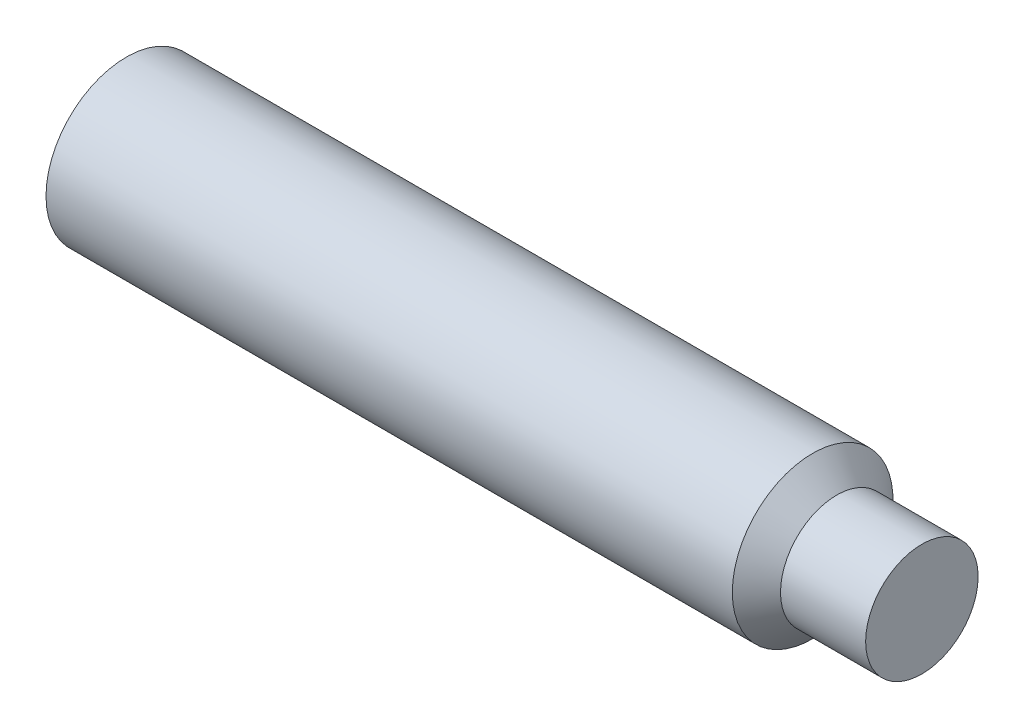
ISO-10303-21;
HEADER;
FILE_DESCRIPTION(('STEP AP214'),'2;1');
FILE_NAME('part.step','',(''),(''),'','','');
FILE_SCHEMA(('AUTOMOTIVE_DESIGN { 1 0 10303 214 1 1 1 1 }'));
ENDSEC;
DATA;
#1=APPLICATION_CONTEXT('core data for automotive mechanical design processes');
#2=APPLICATION_PROTOCOL_DEFINITION('international standard','automotive_design',2000,#1);
#3=PRODUCT_CONTEXT('',#1,'mechanical');
#4=PRODUCT('Part','Part','',(#3));
#5=PRODUCT_RELATED_PRODUCT_CATEGORY('part','',(#4));
#6=PRODUCT_DEFINITION_FORMATION('','',#4);
#7=PRODUCT_DEFINITION_CONTEXT('part definition',#1,'design');
#8=PRODUCT_DEFINITION('design','',#6,#7);
#9=PRODUCT_DEFINITION_SHAPE('','',#8);
#10=(LENGTH_UNIT() NAMED_UNIT(*) SI_UNIT(.MILLI.,.METRE.));
#11=(NAMED_UNIT(*) PLANE_ANGLE_UNIT() SI_UNIT($,.RADIAN.));
#12=(NAMED_UNIT(*) SI_UNIT($,.STERADIAN.) SOLID_ANGLE_UNIT());
#13=UNCERTAINTY_MEASURE_WITH_UNIT(LENGTH_MEASURE(1.E-05),#10,'distance_accuracy_value','');
#14=(GEOMETRIC_REPRESENTATION_CONTEXT(3) GLOBAL_UNCERTAINTY_ASSIGNED_CONTEXT((#13)) GLOBAL_UNIT_ASSIGNED_CONTEXT((#10,
#11,#12)) REPRESENTATION_CONTEXT('',''));
#15=CARTESIAN_POINT('',(0.,0.,0.));
#16=DIRECTION('',(0.,0.,1.));
#17=DIRECTION('',(1.,0.,0.));
#18=AXIS2_PLACEMENT_3D('',#15,#16,#17);
#19=CARTESIAN_POINT('',(0.,0.,0.));
#20=DIRECTION('',(-1.,0.,0.));
#21=DIRECTION('',(0.,0.,1.));
#22=AXIS2_PLACEMENT_3D('',#19,#20,#21);
#23=PLANE('',#22);
#24=CARTESIAN_POINT('',(0.,0.,0.));
#25=DIRECTION('',(-1.,0.,0.));
#26=DIRECTION('',(0.,0.,1.));
#27=AXIS2_PLACEMENT_3D('',#24,#25,#26);
#28=CIRCLE('',#27,4.172);
#29=CARTESIAN_POINT('',(0.,0.,4.172));
#30=VERTEX_POINT('',#29);
#31=EDGE_CURVE('E11',#30,#30,#28,.T.);
#32=ORIENTED_EDGE('',*,*,#31,.T.);
#33=EDGE_LOOP('',(#32));
#34=FACE_BOUND('',#33,.T.);
#35=DIRECTION('',(0.,0.,-1.));
#36=VECTOR('',#35,1.);
#37=CARTESIAN_POINT('',(0.,2.5,1.44337567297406));
#38=LINE('',#37,#36);
#39=CARTESIAN_POINT('',(0.,2.5,1.44337567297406));
#40=VERTEX_POINT('',#39);
#41=CARTESIAN_POINT('',(0.,2.5,-1.44337567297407));
#42=VERTEX_POINT('',#41);
#43=EDGE_CURVE('E93',#40,#42,#38,.T.);
#44=ORIENTED_EDGE('',*,*,#43,.F.);
#45=DIRECTION('',(0.,-0.866025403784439,0.5));
#46=VECTOR('',#45,1.);
#47=CARTESIAN_POINT('',(0.,2.5,1.44337567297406));
#48=LINE('',#47,#46);
#49=CARTESIAN_POINT('',(0.,0.,2.88675134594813));
#50=VERTEX_POINT('',#49);
#51=EDGE_CURVE('E38',#40,#50,#48,.T.);
#52=ORIENTED_EDGE('',*,*,#51,.T.);
#53=DIRECTION('',(0.,0.866025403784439,0.5));
#54=VECTOR('',#53,1.);
#55=CARTESIAN_POINT('',(0.,-2.5,1.44337567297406));
#56=LINE('',#55,#54);
#57=CARTESIAN_POINT('',(0.,-2.5,1.44337567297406));
#58=VERTEX_POINT('',#57);
#59=EDGE_CURVE('E83',#58,#50,#56,.T.);
#60=ORIENTED_EDGE('',*,*,#59,.F.);
#61=DIRECTION('',(0.,0.,-1.));
#62=VECTOR('',#61,1.);
#63=CARTESIAN_POINT('',(0.,-2.5,1.44337567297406));
#64=LINE('',#63,#62);
#65=CARTESIAN_POINT('',(0.,-2.5,-1.44337567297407));
#66=VERTEX_POINT('',#65);
#67=EDGE_CURVE('E88',#58,#66,#64,.T.);
#68=ORIENTED_EDGE('',*,*,#67,.T.);
#69=DIRECTION('',(0.,0.866025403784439,-0.5));
#70=VECTOR('',#69,1.);
#71=CARTESIAN_POINT('',(0.,-2.5,-1.44337567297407));
#72=LINE('',#71,#70);
#73=CARTESIAN_POINT('',(0.,0.,-2.88675134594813));
#74=VERTEX_POINT('',#73);
#75=EDGE_CURVE('E97',#66,#74,#72,.T.);
#76=ORIENTED_EDGE('',*,*,#75,.T.);
#77=DIRECTION('',(0.,-0.866025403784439,-0.5));
#78=VECTOR('',#77,1.);
#79=CARTESIAN_POINT('',(0.,2.5,-1.44337567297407));
#80=LINE('',#79,#78);
#81=EDGE_CURVE('E100',#42,#74,#80,.T.);
#82=ORIENTED_EDGE('',*,*,#81,.F.);
#83=EDGE_LOOP('',(#44,#52,#60,#68,#76,#82));
#84=FACE_BOUND('',#83,.T.);
#85=ADVANCED_FACE('F24',(#34,#84),#23,.T.);
#86=CARTESIAN_POINT('',(0.,0.,0.));
#87=DIRECTION('',(1.,0.,0.));
#88=DIRECTION('',(0.,0.,-1.));
#89=AXIS2_PLACEMENT_3D('',#86,#87,#88);
#90=CONICAL_SURFACE('',#89,4.172,1.0471975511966);
#91=CARTESIAN_POINT('',(0.478046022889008,0.,0.));
#92=DIRECTION('',(-1.,0.,0.));
#93=DIRECTION('',(0.,0.,1.));
#94=AXIS2_PLACEMENT_3D('',#91,#92,#93);
#95=CIRCLE('',#94,5.);
#96=CARTESIAN_POINT('',(0.478046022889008,0.,5.));
#97=VERTEX_POINT('',#96);
#98=EDGE_CURVE('E31',#97,#97,#95,.T.);
#99=ORIENTED_EDGE('',*,*,#98,.T.);
#100=EDGE_LOOP('',(#99));
#101=FACE_BOUND('',#100,.T.);
#102=ORIENTED_EDGE('',*,*,#31,.F.);
#103=EDGE_LOOP('',(#102));
#104=FACE_BOUND('',#103,.T.);
#105=ADVANCED_FACE('F135',(#101,#104),#90,.T.);
#106=CARTESIAN_POINT('',(-12.7,0.,0.));
#107=DIRECTION('',(-1.,0.,0.));
#108=DIRECTION('',(0.,0.,1.));
#109=AXIS2_PLACEMENT_3D('',#106,#107,#108);
#110=CYLINDRICAL_SURFACE('',#109,5.);
#111=CARTESIAN_POINT('',(43.2,0.,0.));
#112=DIRECTION('',(-1.,0.,0.));
#113=DIRECTION('',(0.,0.,1.));
#114=AXIS2_PLACEMENT_3D('',#111,#112,#113);
#115=CIRCLE('',#114,5.);
#116=CARTESIAN_POINT('',(43.2,0.,5.));
#117=VERTEX_POINT('',#116);
#118=EDGE_CURVE('E130',#117,#117,#115,.T.);
#119=ORIENTED_EDGE('',*,*,#118,.T.);
#120=EDGE_LOOP('',(#119));
#121=FACE_BOUND('',#120,.T.);
#122=ORIENTED_EDGE('',*,*,#98,.F.);
#123=EDGE_LOOP('',(#122));
#124=FACE_BOUND('',#123,.T.);
#125=ADVANCED_FACE('F138',(#121,#124),#110,.T.);
#126=CARTESIAN_POINT('',(43.2,0.,0.));
#127=DIRECTION('',(-1.,0.,0.));
#128=DIRECTION('',(0.,0.,1.));
#129=AXIS2_PLACEMENT_3D('',#126,#127,#128);
#130=CONICAL_SURFACE('',#129,5.,0.785398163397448);
#131=CARTESIAN_POINT('',(44.7,0.,0.));
#132=DIRECTION('',(-1.,0.,0.));
#133=DIRECTION('',(0.,0.,1.));
#134=AXIS2_PLACEMENT_3D('',#131,#132,#133);
#135=CIRCLE('',#134,3.5);
#136=CARTESIAN_POINT('',(44.7,0.,3.5));
#137=VERTEX_POINT('',#136);
#138=EDGE_CURVE('E127',#137,#137,#135,.T.);
#139=ORIENTED_EDGE('',*,*,#138,.T.);
#140=EDGE_LOOP('',(#139));
#141=FACE_BOUND('',#140,.T.);
#142=ORIENTED_EDGE('',*,*,#118,.F.);
#143=EDGE_LOOP('',(#142));
#144=FACE_BOUND('',#143,.T.);
#145=ADVANCED_FACE('F140',(#141,#144),#130,.T.);
#146=CARTESIAN_POINT('',(-12.7,0.,0.));
#147=DIRECTION('',(-1.,0.,0.));
#148=DIRECTION('',(0.,0.,1.));
#149=AXIS2_PLACEMENT_3D('',#146,#147,#148);
#150=CYLINDRICAL_SURFACE('',#149,3.5);
#151=CARTESIAN_POINT('',(50.,0.,0.));
#152=DIRECTION('',(-1.,0.,0.));
#153=DIRECTION('',(0.,0.,1.));
#154=AXIS2_PLACEMENT_3D('',#151,#152,#153);
#155=CIRCLE('',#154,3.5);
#156=CARTESIAN_POINT('',(50.,0.,3.5));
#157=VERTEX_POINT('',#156);
#158=EDGE_CURVE('E79',#157,#157,#155,.T.);
#159=ORIENTED_EDGE('',*,*,#158,.T.);
#160=EDGE_LOOP('',(#159));
#161=FACE_BOUND('',#160,.T.);
#162=ORIENTED_EDGE('',*,*,#138,.F.);
#163=EDGE_LOOP('',(#162));
#164=FACE_BOUND('',#163,.T.);
#165=ADVANCED_FACE('F147',(#161,#164),#150,.T.);
#166=CARTESIAN_POINT('',(50.,3.5,0.));
#167=DIRECTION('',(1.,0.,0.));
#168=DIRECTION('',(0.,0.,-1.));
#169=AXIS2_PLACEMENT_3D('',#166,#167,#168);
#170=PLANE('',#169);
#171=ORIENTED_EDGE('',*,*,#158,.F.);
#172=EDGE_LOOP('',(#171));
#173=FACE_BOUND('',#172,.T.);
#174=ADVANCED_FACE('F173',(#173),#170,.T.);
#175=CARTESIAN_POINT('',(6.,2.5,1.44337567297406));
#176=DIRECTION('',(0.,-0.5,-0.866025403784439));
#177=DIRECTION('',(0.,0.866025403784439,-0.5));
#178=AXIS2_PLACEMENT_3D('',#175,#176,#177);
#179=PLANE('',#178);
#180=ORIENTED_EDGE('',*,*,#51,.F.);
#181=DIRECTION('',(-1.,0.,0.));
#182=VECTOR('',#181,1.);
#183=CARTESIAN_POINT('',(6.,2.5,1.44337567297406));
#184=LINE('',#183,#182);
#185=CARTESIAN_POINT('',(6.,2.5,1.44337567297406));
#186=VERTEX_POINT('',#185);
#187=EDGE_CURVE('E42',#186,#40,#184,.T.);
#188=ORIENTED_EDGE('',*,*,#187,.F.);
#189=DIRECTION('',(0.,-0.866025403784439,0.5));
#190=VECTOR('',#189,1.);
#191=CARTESIAN_POINT('',(6.,2.5,1.44337567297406));
#192=LINE('',#191,#190);
#193=CARTESIAN_POINT('',(6.,0.,2.88675134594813));
#194=VERTEX_POINT('',#193);
#195=EDGE_CURVE('E75',#186,#194,#192,.T.);
#196=ORIENTED_EDGE('',*,*,#195,.T.);
#197=DIRECTION('',(-1.,0.,0.));
#198=VECTOR('',#197,1.);
#199=CARTESIAN_POINT('',(6.,0.,2.88675134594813));
#200=LINE('',#199,#198);
#201=EDGE_CURVE('E72',#194,#50,#200,.T.);
#202=ORIENTED_EDGE('',*,*,#201,.T.);
#203=EDGE_LOOP('',(#180,#188,#196,#202));
#204=FACE_BOUND('',#203,.T.);
#205=ADVANCED_FACE('F74',(#204),#179,.T.);
#206=CARTESIAN_POINT('',(6.,-2.5,1.44337567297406));
#207=DIRECTION('',(0.,-0.5,0.866025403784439));
#208=DIRECTION('',(0.,-0.866025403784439,-0.5));
#209=AXIS2_PLACEMENT_3D('',#206,#207,#208);
#210=PLANE('',#209);
#211=ORIENTED_EDGE('',*,*,#59,.T.);
#212=ORIENTED_EDGE('',*,*,#201,.F.);
#213=DIRECTION('',(0.,0.866025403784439,0.5));
#214=VECTOR('',#213,1.);
#215=CARTESIAN_POINT('',(6.,-2.5,1.44337567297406));
#216=LINE('',#215,#214);
#217=CARTESIAN_POINT('',(6.,-2.5,1.44337567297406));
#218=VERTEX_POINT('',#217);
#219=EDGE_CURVE('E105',#218,#194,#216,.T.);
#220=ORIENTED_EDGE('',*,*,#219,.F.);
#221=DIRECTION('',(-1.,0.,0.));
#222=VECTOR('',#221,1.);
#223=CARTESIAN_POINT('',(6.,-2.5,1.44337567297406));
#224=LINE('',#223,#222);
#225=EDGE_CURVE('E80',#218,#58,#224,.T.);
#226=ORIENTED_EDGE('',*,*,#225,.T.);
#227=EDGE_LOOP('',(#211,#212,#220,#226));
#228=FACE_BOUND('',#227,.T.);
#229=ADVANCED_FACE('F84',(#228),#210,.F.);
#230=CARTESIAN_POINT('',(6.,-2.5,1.44337567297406));
#231=DIRECTION('',(0.,1.,0.));
#232=DIRECTION('',(0.,0.,1.));
#233=AXIS2_PLACEMENT_3D('',#230,#231,#232);
#234=PLANE('',#233);
#235=ORIENTED_EDGE('',*,*,#67,.F.);
#236=ORIENTED_EDGE('',*,*,#225,.F.);
#237=DIRECTION('',(0.,0.,-1.));
#238=VECTOR('',#237,1.);
#239=CARTESIAN_POINT('',(6.,-2.5,1.44337567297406));
#240=LINE('',#239,#238);
#241=CARTESIAN_POINT('',(6.,-2.5,-1.44337567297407));
#242=VERTEX_POINT('',#241);
#243=EDGE_CURVE('E107',#218,#242,#240,.T.);
#244=ORIENTED_EDGE('',*,*,#243,.T.);
#245=DIRECTION('',(-1.,0.,0.));
#246=VECTOR('',#245,1.);
#247=CARTESIAN_POINT('',(6.,-2.5,-1.44337567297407));
#248=LINE('',#247,#246);
#249=EDGE_CURVE('E122',#242,#66,#248,.T.);
#250=ORIENTED_EDGE('',*,*,#249,.T.);
#251=EDGE_LOOP('',(#235,#236,#244,#250));
#252=FACE_BOUND('',#251,.T.);
#253=ADVANCED_FACE('F192',(#252),#234,.T.);
#254=CARTESIAN_POINT('',(6.,-2.5,-1.44337567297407));
#255=DIRECTION('',(0.,0.5,0.866025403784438));
#256=DIRECTION('',(0.,-0.866025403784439,0.5));
#257=AXIS2_PLACEMENT_3D('',#254,#255,#256);
#258=PLANE('',#257);
#259=ORIENTED_EDGE('',*,*,#75,.F.);
#260=ORIENTED_EDGE('',*,*,#249,.F.);
#261=DIRECTION('',(0.,0.866025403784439,-0.5));
#262=VECTOR('',#261,1.);
#263=CARTESIAN_POINT('',(6.,-2.5,-1.44337567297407));
#264=LINE('',#263,#262);
#265=CARTESIAN_POINT('',(6.,0.,-2.88675134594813));
#266=VERTEX_POINT('',#265);
#267=EDGE_CURVE('E109',#242,#266,#264,.T.);
#268=ORIENTED_EDGE('',*,*,#267,.T.);
#269=DIRECTION('',(-1.,0.,0.));
#270=VECTOR('',#269,1.);
#271=CARTESIAN_POINT('',(6.,0.,-2.88675134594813));
#272=LINE('',#271,#270);
#273=EDGE_CURVE('E120',#266,#74,#272,.T.);
#274=ORIENTED_EDGE('',*,*,#273,.T.);
#275=EDGE_LOOP('',(#259,#260,#268,#274));
#276=FACE_BOUND('',#275,.T.);
#277=ADVANCED_FACE('F199',(#276),#258,.T.);
#278=CARTESIAN_POINT('',(6.,2.5,-1.44337567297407));
#279=DIRECTION('',(0.,0.5,-0.866025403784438));
#280=DIRECTION('',(0.,0.866025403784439,0.5));
#281=AXIS2_PLACEMENT_3D('',#278,#279,#280);
#282=PLANE('',#281);
#283=ORIENTED_EDGE('',*,*,#81,.T.);
#284=ORIENTED_EDGE('',*,*,#273,.F.);
#285=DIRECTION('',(0.,-0.866025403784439,-0.5));
#286=VECTOR('',#285,1.);
#287=CARTESIAN_POINT('',(6.,2.5,-1.44337567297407));
#288=LINE('',#287,#286);
#289=CARTESIAN_POINT('',(6.,2.5,-1.44337567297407));
#290=VERTEX_POINT('',#289);
#291=EDGE_CURVE('E111',#290,#266,#288,.T.);
#292=ORIENTED_EDGE('',*,*,#291,.F.);
#293=DIRECTION('',(-1.,0.,0.));
#294=VECTOR('',#293,1.);
#295=CARTESIAN_POINT('',(6.,2.5,-1.44337567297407));
#296=LINE('',#295,#294);
#297=EDGE_CURVE('E118',#290,#42,#296,.T.);
#298=ORIENTED_EDGE('',*,*,#297,.T.);
#299=EDGE_LOOP('',(#283,#284,#292,#298));
#300=FACE_BOUND('',#299,.T.);
#301=ADVANCED_FACE('F207',(#300),#282,.F.);
#302=CARTESIAN_POINT('',(6.,2.5,1.44337567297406));
#303=DIRECTION('',(0.,1.,0.));
#304=DIRECTION('',(0.,0.,1.));
#305=AXIS2_PLACEMENT_3D('',#302,#303,#304);
#306=PLANE('',#305);
#307=ORIENTED_EDGE('',*,*,#43,.T.);
#308=ORIENTED_EDGE('',*,*,#297,.F.);
#309=DIRECTION('',(0.,0.,-1.));
#310=VECTOR('',#309,1.);
#311=CARTESIAN_POINT('',(6.,2.5,1.44337567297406));
#312=LINE('',#311,#310);
#313=EDGE_CURVE('E114',#186,#290,#312,.T.);
#314=ORIENTED_EDGE('',*,*,#313,.F.);
#315=ORIENTED_EDGE('',*,*,#187,.T.);
#316=EDGE_LOOP('',(#307,#308,#314,#315));
#317=FACE_BOUND('',#316,.T.);
#318=ADVANCED_FACE('F215',(#317),#306,.F.);
#319=CARTESIAN_POINT('',(6.,2.5,1.44337567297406));
#320=DIRECTION('',(1.,0.,0.));
#321=DIRECTION('',(0.,0.,-1.));
#322=AXIS2_PLACEMENT_3D('',#319,#320,#321);
#323=PLANE('',#322);
#324=ORIENTED_EDGE('',*,*,#195,.F.);
#325=ORIENTED_EDGE('',*,*,#313,.T.);
#326=ORIENTED_EDGE('',*,*,#291,.T.);
#327=ORIENTED_EDGE('',*,*,#267,.F.);
#328=ORIENTED_EDGE('',*,*,#243,.F.);
#329=ORIENTED_EDGE('',*,*,#219,.T.);
#330=EDGE_LOOP('',(#324,#325,#326,#327,#328,#329));
#331=FACE_BOUND('',#330,.T.);
#332=ADVANCED_FACE('F223',(#331),#323,.F.);
#333=CLOSED_SHELL('',(#85,#105,#125,#145,#165,#174,#205,#229,#253,#277,#301,#318,#332));
#334=MANIFOLD_SOLID_BREP('B2',#333);
#335=ADVANCED_BREP_SHAPE_REPRESENTATION('',(#18,#334),#14);
#336=SHAPE_DEFINITION_REPRESENTATION(#9,#335);
ENDSEC;
END-ISO-10303-21;
